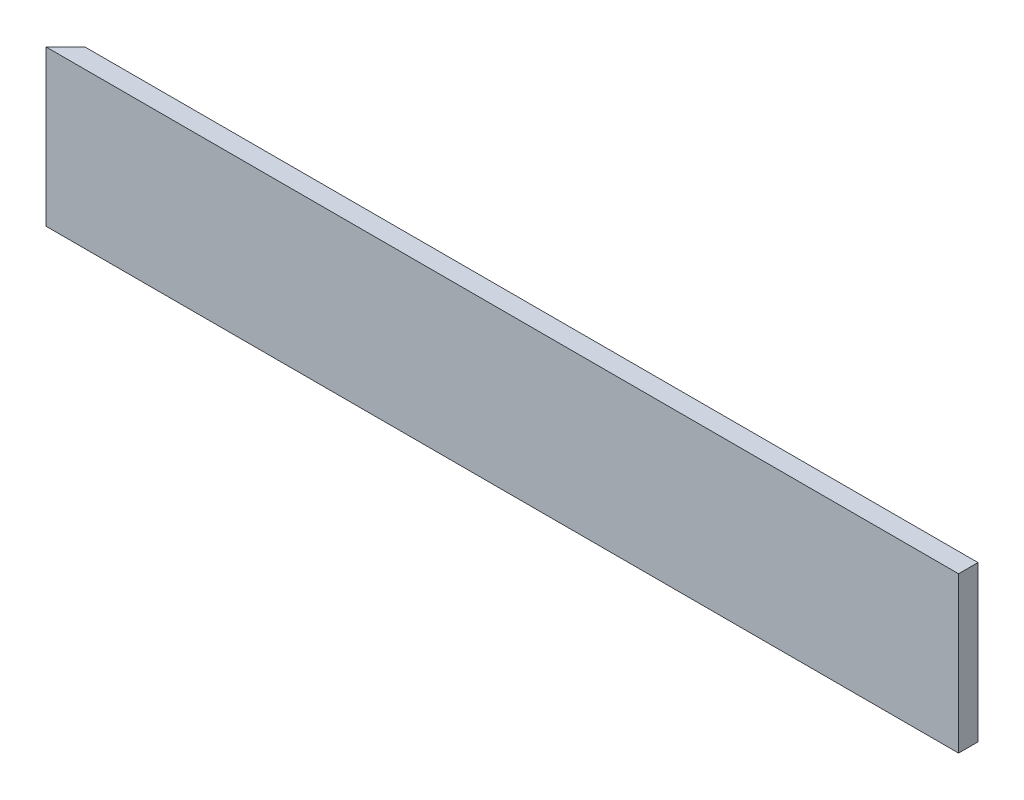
from build123d import *

# Parameters (mm, degrees)
BOSS_EXTRUDE1_DEPTH = 203.2


with BuildPart() as part:
    # Sketch2 → Boss-Extrude1 (new body)
    with BuildSketch(Plane(origin=(0, 0, 0), x_dir=(1, 0, 0), z_dir=(0, 1, 0))):
        Polygon((0, 0), (0, -25.4), (-1193.8, -25.4), (-1168.4, 0), align=None)
    extrude(amount=BOSS_EXTRUDE1_DEPTH)


solid = part.part
